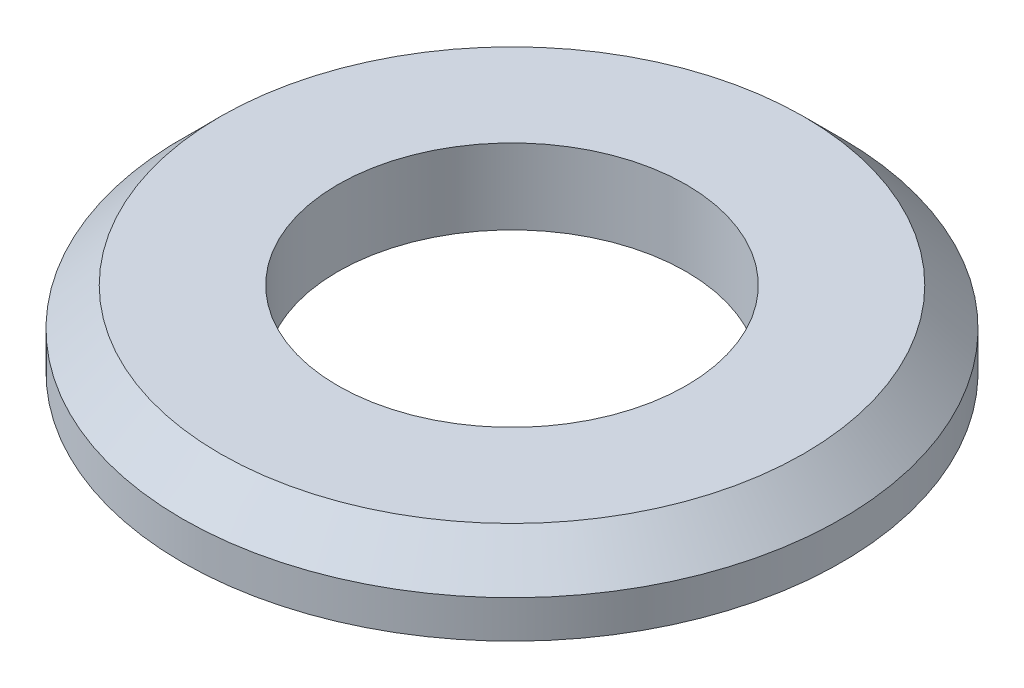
ISO-10303-21;
HEADER;
FILE_DESCRIPTION(('STEP AP214'),'2;1');
FILE_NAME('part.step','',(''),(''),'','','');
FILE_SCHEMA(('AUTOMOTIVE_DESIGN { 1 0 10303 214 1 1 1 1 }'));
ENDSEC;
DATA;
#1=APPLICATION_CONTEXT('core data for automotive mechanical design processes');
#2=APPLICATION_PROTOCOL_DEFINITION('international standard','automotive_design',2000,#1);
#3=PRODUCT_CONTEXT('',#1,'mechanical');
#4=PRODUCT('Part','Part','',(#3));
#5=PRODUCT_RELATED_PRODUCT_CATEGORY('part','',(#4));
#6=PRODUCT_DEFINITION_FORMATION('','',#4);
#7=PRODUCT_DEFINITION_CONTEXT('part definition',#1,'design');
#8=PRODUCT_DEFINITION('design','',#6,#7);
#9=PRODUCT_DEFINITION_SHAPE('','',#8);
#10=(LENGTH_UNIT() NAMED_UNIT(*) SI_UNIT(.MILLI.,.METRE.));
#11=(NAMED_UNIT(*) PLANE_ANGLE_UNIT() SI_UNIT($,.RADIAN.));
#12=(NAMED_UNIT(*) SI_UNIT($,.STERADIAN.) SOLID_ANGLE_UNIT());
#13=UNCERTAINTY_MEASURE_WITH_UNIT(LENGTH_MEASURE(1.E-05),#10,'distance_accuracy_value','');
#14=(GEOMETRIC_REPRESENTATION_CONTEXT(3) GLOBAL_UNCERTAINTY_ASSIGNED_CONTEXT((#13)) GLOBAL_UNIT_ASSIGNED_CONTEXT((#10,
#11,#12)) REPRESENTATION_CONTEXT('',''));
#15=CARTESIAN_POINT('',(0.,0.,0.));
#16=DIRECTION('',(0.,0.,1.));
#17=DIRECTION('',(1.,0.,0.));
#18=AXIS2_PLACEMENT_3D('',#15,#16,#17);
#19=CARTESIAN_POINT('',(0.,1.6,0.));
#20=DIRECTION('',(0.,1.,0.));
#21=DIRECTION('',(0.,0.,1.));
#22=AXIS2_PLACEMENT_3D('',#19,#20,#21);
#23=PLANE('',#22);
#24=CARTESIAN_POINT('',(0.,1.6,0.));
#25=DIRECTION('',(0.,1.,0.));
#26=DIRECTION('',(0.,0.,1.));
#27=AXIS2_PLACEMENT_3D('',#24,#25,#26);
#28=CIRCLE('',#27,6.2);
#29=CARTESIAN_POINT('',(0.,1.6,6.2));
#30=VERTEX_POINT('',#29);
#31=EDGE_CURVE('E35',#30,#30,#28,.T.);
#32=ORIENTED_EDGE('',*,*,#31,.T.);
#33=EDGE_LOOP('',(#32));
#34=FACE_BOUND('',#33,.T.);
#35=CARTESIAN_POINT('',(0.,1.6,0.));
#36=DIRECTION('',(0.,1.,0.));
#37=DIRECTION('',(0.,0.,1.));
#38=AXIS2_PLACEMENT_3D('',#35,#36,#37);
#39=CIRCLE('',#38,3.7);
#40=CARTESIAN_POINT('',(0.,1.6,3.7));
#41=VERTEX_POINT('',#40);
#42=EDGE_CURVE('E43',#41,#41,#39,.T.);
#43=ORIENTED_EDGE('',*,*,#42,.F.);
#44=EDGE_LOOP('',(#43));
#45=FACE_BOUND('',#44,.T.);
#46=ADVANCED_FACE('F28',(#34,#45),#23,.T.);
#47=CARTESIAN_POINT('',(0.,0.,0.));
#48=DIRECTION('',(0.,1.,0.));
#49=DIRECTION('',(0.,0.,1.));
#50=AXIS2_PLACEMENT_3D('',#47,#48,#49);
#51=PLANE('',#50);
#52=CARTESIAN_POINT('',(0.,0.,0.));
#53=DIRECTION('',(0.,1.,0.));
#54=DIRECTION('',(0.,0.,1.));
#55=AXIS2_PLACEMENT_3D('',#52,#53,#54);
#56=CIRCLE('',#55,7.);
#57=CARTESIAN_POINT('',(0.,0.,7.));
#58=VERTEX_POINT('',#57);
#59=EDGE_CURVE('E39',#58,#58,#56,.T.);
#60=ORIENTED_EDGE('',*,*,#59,.F.);
#61=EDGE_LOOP('',(#60));
#62=FACE_BOUND('',#61,.T.);
#63=CARTESIAN_POINT('',(0.,0.,0.));
#64=DIRECTION('',(0.,1.,0.));
#65=DIRECTION('',(0.,0.,1.));
#66=AXIS2_PLACEMENT_3D('',#63,#64,#65);
#67=CIRCLE('',#66,3.7);
#68=CARTESIAN_POINT('',(0.,0.,3.7));
#69=VERTEX_POINT('',#68);
#70=EDGE_CURVE('E48',#69,#69,#67,.T.);
#71=ORIENTED_EDGE('',*,*,#70,.T.);
#72=EDGE_LOOP('',(#71));
#73=FACE_BOUND('',#72,.T.);
#74=ADVANCED_FACE('F52',(#62,#73),#51,.F.);
#75=CARTESIAN_POINT('',(0.,1.6,0.));
#76=DIRECTION('',(0.,-1.,0.));
#77=DIRECTION('',(0.,0.,-1.));
#78=AXIS2_PLACEMENT_3D('',#75,#76,#77);
#79=CYLINDRICAL_SURFACE('',#78,7.);
#80=CARTESIAN_POINT('',(0.,0.8,0.));
#81=DIRECTION('',(0.,1.,0.));
#82=DIRECTION('',(0.,0.,1.));
#83=AXIS2_PLACEMENT_3D('',#80,#81,#82);
#84=CIRCLE('',#83,7.);
#85=CARTESIAN_POINT('',(0.,0.8,7.));
#86=VERTEX_POINT('',#85);
#87=EDGE_CURVE('E10',#86,#86,#84,.F.);
#88=ORIENTED_EDGE('',*,*,#87,.T.);
#89=EDGE_LOOP('',(#88));
#90=FACE_BOUND('',#89,.T.);
#91=ORIENTED_EDGE('',*,*,#59,.T.);
#92=EDGE_LOOP('',(#91));
#93=FACE_BOUND('',#92,.T.);
#94=ADVANCED_FACE('F30',(#90,#93),#79,.T.);
#95=CARTESIAN_POINT('',(0.,1.6,0.));
#96=DIRECTION('',(0.,-1.,0.));
#97=DIRECTION('',(0.,0.,-1.));
#98=AXIS2_PLACEMENT_3D('',#95,#96,#97);
#99=CYLINDRICAL_SURFACE('',#98,3.7);
#100=ORIENTED_EDGE('',*,*,#42,.T.);
#101=EDGE_LOOP('',(#100));
#102=FACE_BOUND('',#101,.T.);
#103=ORIENTED_EDGE('',*,*,#70,.F.);
#104=EDGE_LOOP('',(#103));
#105=FACE_BOUND('',#104,.T.);
#106=ADVANCED_FACE('F54',(#102,#105),#99,.F.);
#107=CARTESIAN_POINT('',(0.,1.6,0.));
#108=DIRECTION('',(0.,-1.,0.));
#109=DIRECTION('',(0.,0.,-1.));
#110=AXIS2_PLACEMENT_3D('',#107,#108,#109);
#111=CONICAL_SURFACE('',#110,6.2,0.78539816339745);
#112=ORIENTED_EDGE('',*,*,#87,.F.);
#113=EDGE_LOOP('',(#112));
#114=FACE_BOUND('',#113,.T.);
#115=ORIENTED_EDGE('',*,*,#31,.F.);
#116=EDGE_LOOP('',(#115));
#117=FACE_BOUND('',#116,.T.);
#118=ADVANCED_FACE('F56',(#114,#117),#111,.T.);
#119=CLOSED_SHELL('',(#46,#74,#94,#106,#118));
#120=MANIFOLD_SOLID_BREP('B2',#119);
#121=ADVANCED_BREP_SHAPE_REPRESENTATION('',(#18,#120),#14);
#122=SHAPE_DEFINITION_REPRESENTATION(#9,#121);
ENDSEC;
END-ISO-10303-21;
